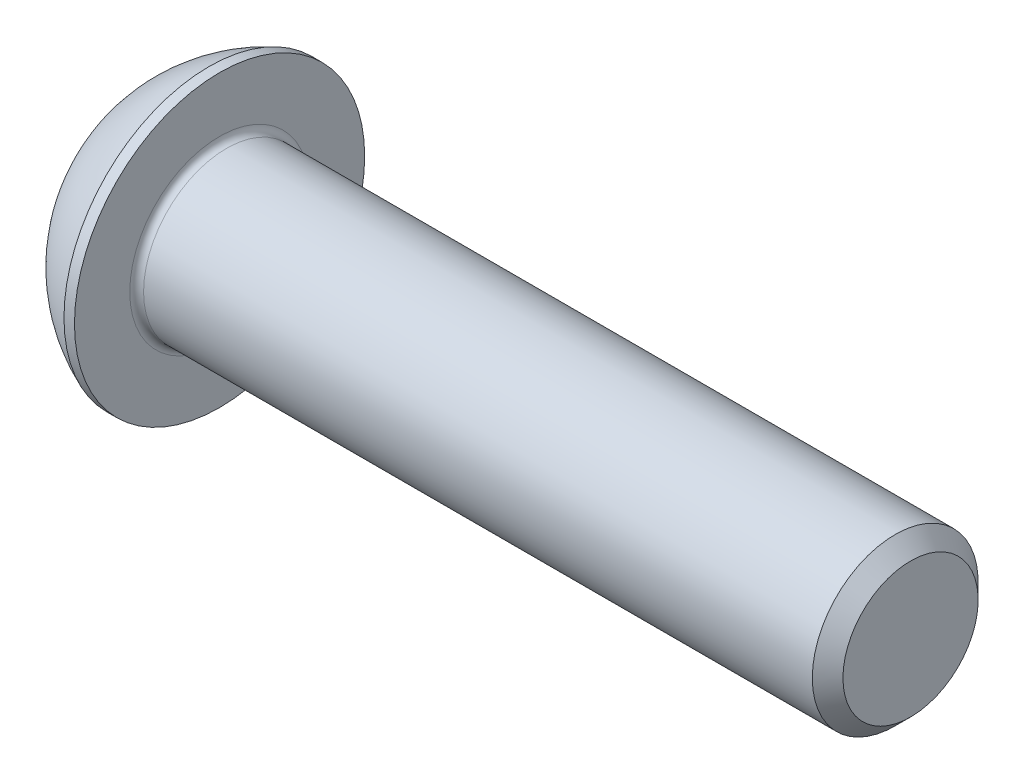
from build123d import *

# Parameters (mm, degrees)
FILLET1_R   = 0.25
HEX_2_DEPTH = 2.08


with BuildPart() as part:
    # BodySke → BaseBody (revolve)
    with BuildSketch(Plane.XY, mode=Mode.PRIVATE) as basebody_sk:
        with BuildLine():
            Line((28.3, 0), (28.3, 2.4455))
            Line((28.3, 2.4455), (27.7455, 3))
            Line((27.7455, 3), (3.3, 3))
            Line((3.3, 3), (3.3, 5.25))
            Line((3.3, 5.25), (2.92, 5.25))
            ThreePointArc((2.92, 5.25), (1.224500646, 4.199464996), (0, 2.625))
            Line((0, 2.625), (0, 0))
            Line((0, 0), (28.3, 0))
        make_face()
    revolve(basebody_sk.sketch.rotate(Axis((0, 0, 0), (1, 0, 0)), 90), axis=Axis((0, 0, 0), (1, 0, 0)))

    # Fillet1
    fillet1_edges = [part.edges().sort_by_distance(p)[0] for p in [
        (3.3, 0, -3),
    ]]
    fillet(fillet1_edges, radius=FILLET1_R)

    # Sketch2 → PreBroach (revolve, cut)
    with BuildSketch(Plane.XY, mode=Mode.PRIVATE) as prebroach_sk:
        Polygon((0, 2), (2.08, 2), (3.234700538, 0), (0, 0), align=None)
    revolve(prebroach_sk.sketch.rotate(Axis((0, 0, 0), (1, 0, 0)), 90), axis=Axis((0, 0, 0), (1, 0, 0)), mode=Mode.SUBTRACT)

    # Sketch3 → Hex 2 (cut)
    with BuildSketch(Plane(origin=(0, 0, 0), x_dir=(0, 0, -1), z_dir=(1, 0, 0))):
        Polygon((-2, -1.154700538), (-2, 1.154700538), (0, 2.309401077), (2, 1.154700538), (2, -1.154700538), (0, -2.309401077), align=None)
    extrude(amount=HEX_2_DEPTH, mode=Mode.SUBTRACT)


solid = part.part
